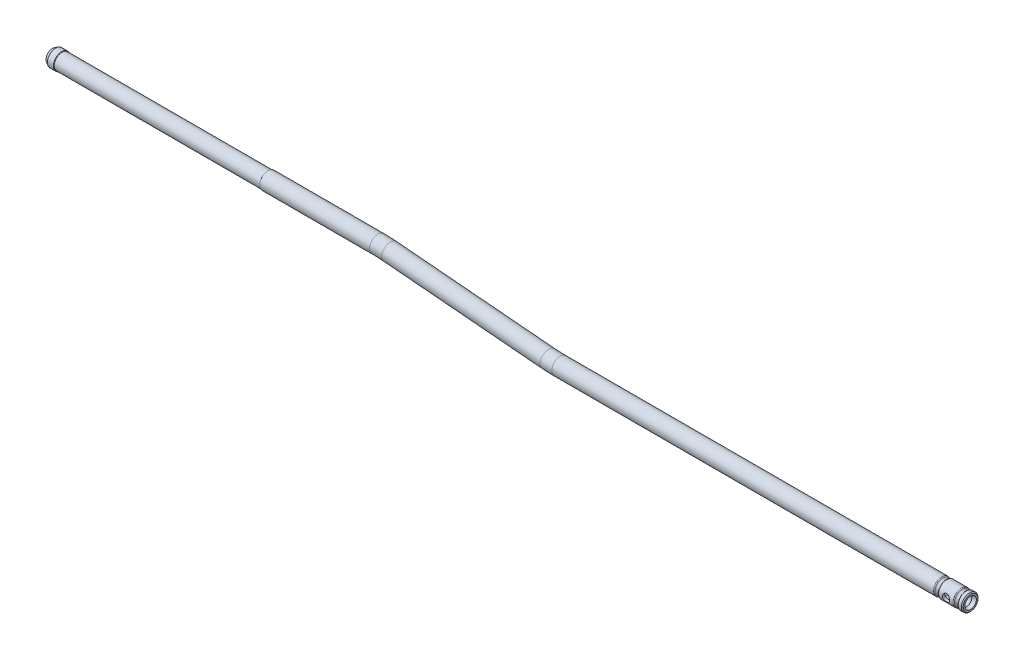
from build123d import *
from build123d.topology import SkipClean

# Parameters (mm, degrees)
SKETCH1_4_R        = 0.9906
CUT_EXTRUDE1_DEPTH = 3.81
SKETCH4_R          = 2.286
SKETCH4_R_2        = 1.397
SKETCH5_R          = 1.5875
CUT_EXTRUDE2_DEPTH = 7.62


with BuildPart() as part:
    # Sketch1 → Revolve1 (revolve)
    with BuildSketch(Plane.XY):
        with BuildLine():
            Line((-7.800308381, 1.5875), (-9.651968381, 1.5875))
            Line((-9.651968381, 1.5875), (-9.766432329, 1.397))
            Line((-9.766432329, 1.397), (-16.9545, 1.397))
            Line((-16.9545, 1.397), (-16.9545, 2.286))
            Line((-16.9545, 2.286), (-7.90662049, 2.286))
            ThreePointArc((-7.90662049, 2.286), (-7.759973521, 2.239390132), (-7.667146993, 2.116666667))
            ThreePointArc((-7.667146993, 2.116666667), (-7.1882, 1.778), (-6.709253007, 2.116666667))
            ThreePointArc((-6.709253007, 2.116666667), (-6.616426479, 2.239390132), (-6.46977951, 2.286))
            Line((-6.46977951, 2.286), (-2.52182049, 2.286))
            ThreePointArc((-2.52182049, 2.286), (-2.375173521, 2.239390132), (-2.282346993, 2.116666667))
            ThreePointArc((-2.282346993, 2.116666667), (-1.8034, 1.778), (-1.324453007, 2.116666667))
            ThreePointArc((-1.324453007, 2.116666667), (-1.231626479, 2.239390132), (-1.08497951, 2.286))
            Line((-1.08497951, 2.286), (-0.254, 2.286))
            Line((-0.254, 2.286), (0, 2.032))
            Line((0, 2.032), (0, 1.5875))
            Line((0, 1.5875), (-1.191291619, 1.5875))
            ThreePointArc((-1.191291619, 1.5875), (-1.8034, 1.2954), (-2.415508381, 1.5875))
            Line((-2.415508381, 1.5875), (-6.576091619, 1.5875))
            ThreePointArc((-6.576091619, 1.5875), (-7.1882, 1.2954), (-7.800308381, 1.5875))
        make_face()
    revolve(axis=Axis((0, 0, 0), (-1, 0, 0)))

    # Sketch1_4 → Cut-Extrude1 (cut, symmetric)
    with BuildSketch(Plane.XY):
        with Locations((-4.4958, 0)):
            Circle(SKETCH1_4_R)
    extrude(amount=CUT_EXTRUDE1_DEPTH, both=True, mode=Mode.SUBTRACT)



with BuildPart() as body_2:
    # Sketch2 → Revolve2 (revolve)
    with BuildSketch(Plane.XY, mode=Mode.PRIVATE) as revolve2_sk:
        with BuildLine():
            Line((-249.3264, 6.1849), (-192.9384, 6.1849))
            ThreePointArc((-192.9384, 6.1849), (-192.848597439, 6.222097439), (-192.8114, 6.3119))
            Line((-192.8114, 6.3119), (-192.8114, 5.4229))
            Line((-192.8114, 5.4229), (-251.9934, 5.4229))
            Line((-251.9934, 5.4229), (-251.9934, 5.8039))
            Line((-251.9934, 5.8039), (-251.11351819, 6.3119))
            Line((-251.11351819, 6.3119), (-249.4534, 6.3119))
            ThreePointArc((-249.4534, 6.3119), (-249.416202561, 6.222097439), (-249.3264, 6.1849))
        make_face()
    revolve(revolve2_sk.sketch.rotate(Axis((-251.9934, 4.0259, 0), (1, 0, 0)), 90), axis=Axis((-251.9934, 4.0259, 0), (1, 0, 0)))


with BuildPart() as part_1:
    with SkipClean():  # the faces are left unmerged after this step: merging them gives an invalid solid
        add(part.part)

        add(body_2.part)  # Sweep2 merges body 2
        # Sweep2: sweep along a path in Sketch3
        with BuildLine(Plane.XY) as sweep2_path:
            Line((-192.8114, 4.0259), (-162.673958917, 4.0259))
            ThreePointArc((-162.673958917, 4.0259), (-161.037511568, 3.990739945), (-159.404084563, 3.885324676))
            Line((-159.404084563, 3.885324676), (-115.931915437, 0.140575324))
            ThreePointArc((-115.931915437, 0.140575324), (-114.298488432, 0.035160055), (-112.662041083, 0))
            Line((-112.662041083, 0), (-16.9545, 0))
        # Sketch4 → Sweep2 (sweep)
        with BuildSketch(Plane(origin=(-16.9545, 0, 0), x_dir=(0, 0, -1), z_dir=(1, 0, 0))):
            Circle(SKETCH4_R)
            Circle(SKETCH4_R_2, mode=Mode.SUBTRACT)
        sweep(path=sweep2_path.line)

    # Sketch5 → Cut-Extrude2 (cut)
    with SkipClean():  # the faces are left unmerged after this step: merging them gives an invalid solid
        with BuildSketch(Plane(origin=(0, 0, 0), x_dir=(1, 0, 0), z_dir=(0, 1, 0))):
            with Locations(Location((-15.113, 0, 0), (0, 0, 270))):
                Circle(SKETCH5_R)
        extrude(amount=-CUT_EXTRUDE2_DEPTH, mode=Mode.SUBTRACT)


solid = part_1.part
